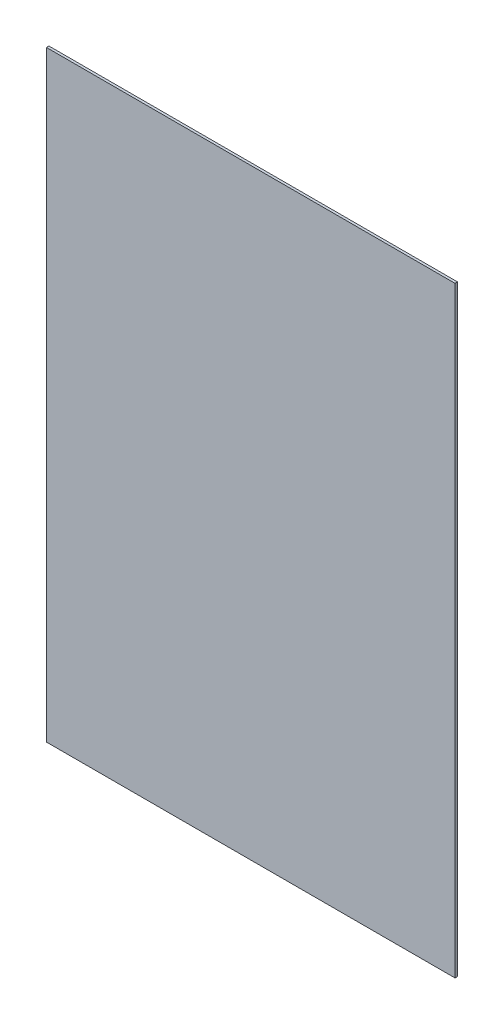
from build123d import *

# Parameters (mm, degrees)
SKETCH2_W           = 914.4
SKETCH2_H           = 1219.2
BOSS_EXTRUDE1_DEPTH = 2.794
SKETCH3_W           = 914.4
SKETCH3_H           = 5.588
BOSS_EXTRUDE2_DEPTH = 127


with BuildPart() as part:
    # Sketch2 → Boss-Extrude1 (new, symmetric)
    with BuildSketch(Plane.XY):
        Rectangle(SKETCH2_W, SKETCH2_H)
    extrude(amount=BOSS_EXTRUDE1_DEPTH, both=True)

    # Sketch3 → Boss-Extrude2 (add)
    with BuildSketch(Plane(origin=(0, 609.6, 0), x_dir=(1, 0, 0), z_dir=(0, 1, 0))):
        Rectangle(SKETCH3_W, SKETCH3_H)
    extrude(amount=BOSS_EXTRUDE2_DEPTH)


solid = part.part
